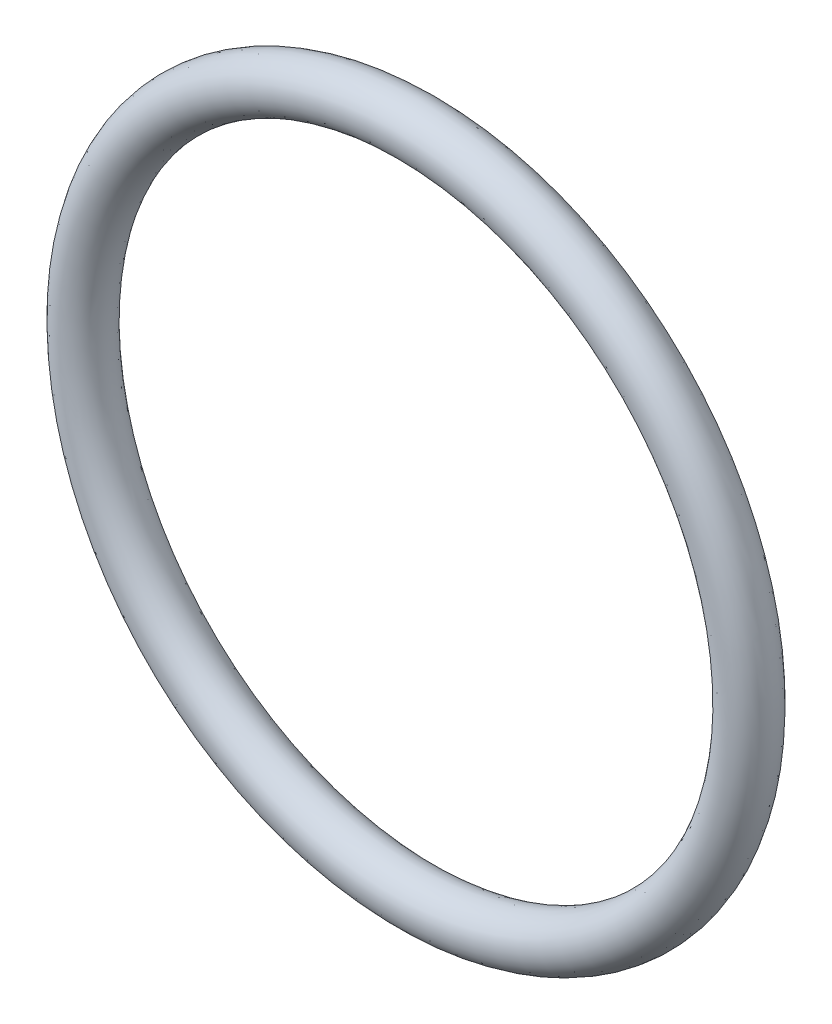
ISO-10303-21;
HEADER;
FILE_DESCRIPTION(('STEP AP214'),'2;1');
FILE_NAME('part.step','',(''),(''),'','','');
FILE_SCHEMA(('AUTOMOTIVE_DESIGN { 1 0 10303 214 1 1 1 1 }'));
ENDSEC;
DATA;
#1=APPLICATION_CONTEXT('core data for automotive mechanical design processes');
#2=APPLICATION_PROTOCOL_DEFINITION('international standard','automotive_design',2000,#1);
#3=PRODUCT_CONTEXT('',#1,'mechanical');
#4=PRODUCT('Part','Part','',(#3));
#5=PRODUCT_RELATED_PRODUCT_CATEGORY('part','',(#4));
#6=PRODUCT_DEFINITION_FORMATION('','',#4);
#7=PRODUCT_DEFINITION_CONTEXT('part definition',#1,'design');
#8=PRODUCT_DEFINITION('design','',#6,#7);
#9=PRODUCT_DEFINITION_SHAPE('','',#8);
#10=(LENGTH_UNIT() NAMED_UNIT(*) SI_UNIT(.MILLI.,.METRE.));
#11=(NAMED_UNIT(*) PLANE_ANGLE_UNIT() SI_UNIT($,.RADIAN.));
#12=(NAMED_UNIT(*) SI_UNIT($,.STERADIAN.) SOLID_ANGLE_UNIT());
#13=UNCERTAINTY_MEASURE_WITH_UNIT(LENGTH_MEASURE(1.E-05),#10,'distance_accuracy_value','');
#14=(GEOMETRIC_REPRESENTATION_CONTEXT(3) GLOBAL_UNCERTAINTY_ASSIGNED_CONTEXT((#13)) GLOBAL_UNIT_ASSIGNED_CONTEXT((#10,
#11,#12)) REPRESENTATION_CONTEXT('',''));
#15=CARTESIAN_POINT('',(0.,0.,0.));
#16=DIRECTION('',(0.,0.,1.));
#17=DIRECTION('',(1.,0.,0.));
#18=AXIS2_PLACEMENT_3D('',#15,#16,#17);
#19=CARTESIAN_POINT('',(0.,13.,1.));
#20=DIRECTION('',(1.,0.,0.));
#21=DIRECTION('',(0.,-1.,0.));
#22=AXIS2_PLACEMENT_3D('',#19,#20,#21);
#23=ELLIPSE('',#22,1.,1.);
#24=CARTESIAN_POINT('',(0.,0.,2.));
#25=DIRECTION('',(0.,0.,1.));
#26=AXIS1_PLACEMENT('',#24,#25);
#27=SURFACE_OF_REVOLUTION('',#23,#26);
#28=ADVANCED_FACE('F33',(),#27,.T.);
#29=CLOSED_SHELL('',(#28));
#30=MANIFOLD_SOLID_BREP('B2',#29);
#31=ADVANCED_BREP_SHAPE_REPRESENTATION('',(#18,#30),#14);
#32=SHAPE_DEFINITION_REPRESENTATION(#9,#31);
ENDSEC;
END-ISO-10303-21;
